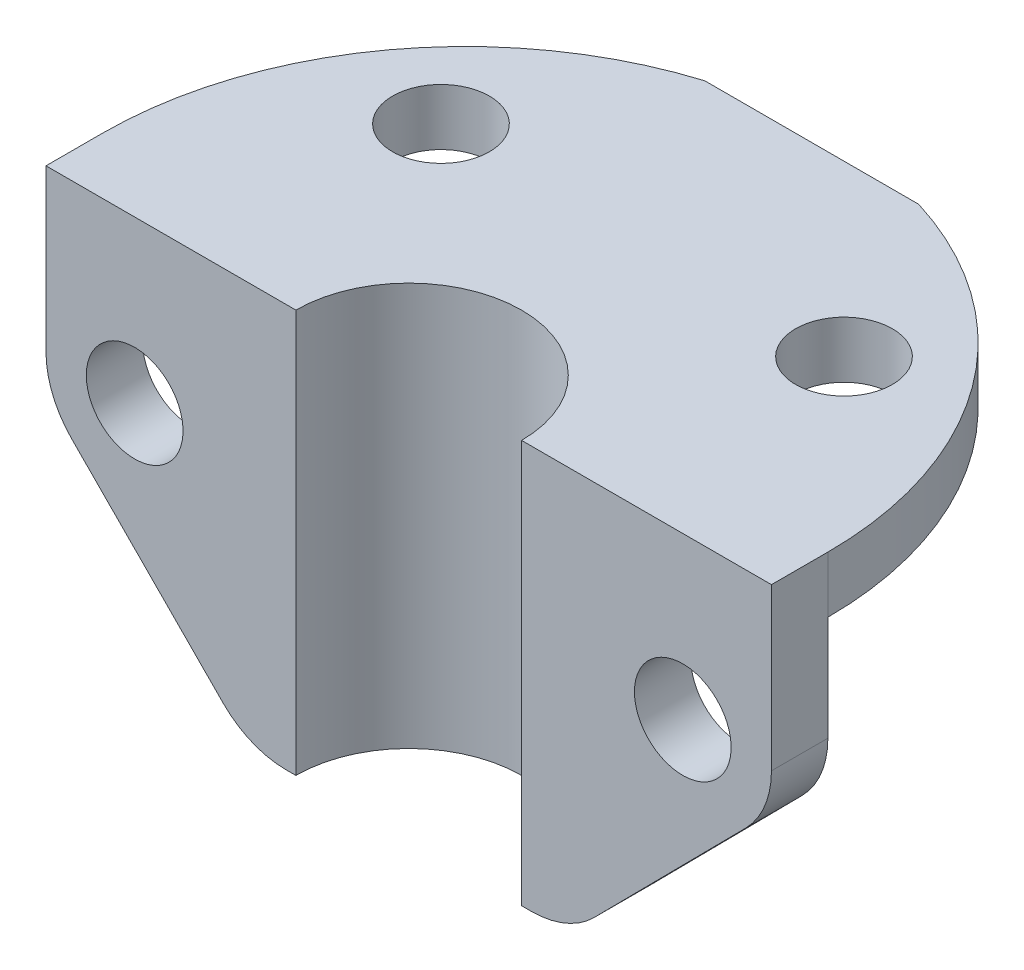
from build123d import *

# Parameters (mm, degrees)
RESSALTO_EXTRUS_O9_DEPTH  = 50
ESBO_O5_R                 = 6
CORTE_EXTRUS_O1_DEPTH     = 43
CORTE_EXTRUS_O2_DEPTH     = 43
FILETE1_R                 = 11
CORTE_EXTRUS_O3_DEPTH     = 43
FILETE2_R                 = 11
RESSALTO_EXTRUS_O12_START = -7
RESSALTO_EXTRUS_O12_DEPTH = 7
ESBO_O12_W                = 90
ESBO_O12_H                = 5
CORTE_EXTRUS_O7_DEPTH     = 7
ESBO_O13_R                = 6
CORTE_EXTRUS_O8_DEPTH     = 7


with BuildPart() as part:
    # Esbo_o4 → Ressalto-extrus_o9 (new body)
    with BuildSketch(Plane(origin=(0, 0, 0), x_dir=(1, 0, 0), z_dir=(0, 1, 0))):
        with BuildLine():
            Line((32.875644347, 0), (25.201010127, 0))
            ThreePointArc((25.201010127, 0), (24.302430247, -3.448858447), (24, -7))
            Line((24, -7), (31, -7))
            ThreePointArc((31, -7), (31.477038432, -3.376533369), (32.875644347, 0))
        make_face()
        with BuildLine():
            ThreePointArc((66, -7), (65.697569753, -3.448858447), (64.798989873, 0))
            Line((64.798989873, 0), (57.124355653, 0))
            ThreePointArc((57.124355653, 0), (58.522961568, -3.376533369), (59, -7))
            Line((59, -7), (66, -7))
        make_face()
        with BuildLine():
            Line((32.875644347, 0), (25.201010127, 0))
            ThreePointArc((25.201010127, 0), (24.302430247, -3.448858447), (24, -7))
            Line((24, -7), (31, -7))
            ThreePointArc((31, -7), (31.477038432, -3.376533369), (32.875644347, 0))
        make_face()
        with BuildLine():
            ThreePointArc((66, -7), (65.697569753, -3.448858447), (64.798989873, 0))
            Line((64.798989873, 0), (57.124355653, 0))
            ThreePointArc((57.124355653, 0), (58.522961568, -3.376533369), (59, -7))
            Line((59, -7), (66, -7))
        make_face()
        with BuildLine():
            ThreePointArc((64.798989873, 0), (45, 14), (25.201010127, 0))
            Line((25.201010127, 0), (32.875644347, 0))
            ThreePointArc((32.875644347, 0), (45, 7), (57.124355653, 0))
            Line((57.124355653, 0), (64.798989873, 0))
        make_face()
        with BuildLine():
            Line((90, 0), (64.798989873, 0))
            ThreePointArc((64.798989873, 0), (65.697569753, -3.448858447), (66, -7))
            Line((66, -7), (90, -7))
            Line((90, -7), (90, 0))
        make_face()
        with BuildLine():
            Line((25.201010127, 0), (0, 0))
            Line((0, 0), (0, -7))
            Line((0, -7), (24, -7))
            ThreePointArc((24, -7), (24.302430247, -3.448858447), (25.201010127, 0))
        make_face()
    extrude(amount=RESSALTO_EXTRUS_O9_DEPTH)

    # Esbo_o5 → Corte-extrus_o1 (cut)
    with BuildSketch(Plane(origin=(0, 0, 0), x_dir=(-1, 0, 0), z_dir=(0, 0, -1))):
        with Locations((-11, 30)):
            Circle(ESBO_O5_R)
        with Locations((-79, 30)):
            Circle(ESBO_O5_R)
    extrude(amount=-CORTE_EXTRUS_O1_DEPTH, mode=Mode.SUBTRACT)

    # Esbo_o6 → Corte-extrus_o2 (cut)
    with BuildSketch(Plane(origin=(0, 0, 0), x_dir=(-1, 0, 0), z_dir=(0, 0, -1))):
        with BuildLine():
            Line((-90, 0), (-64.798989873, 0))
            Line((-64.798989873, 0), (-86.820713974, 22.264598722))
            ThreePointArc((-86.820713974, 22.264598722), (-89.174179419, 25.818364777), (-90, 30))
            Line((-90, 30), (-90, 0))
        make_face()
    extrude(amount=-CORTE_EXTRUS_O2_DEPTH, mode=Mode.SUBTRACT)

    # Filete1
    filete1_edges = [part.edges().sort_by_distance(p)[0] for p in [
        (64.798989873, 0, 3.5),
    ]]
    fillet(filete1_edges, radius=FILETE1_R)

    # Esbo_o6_3 → Corte-extrus_o3 (cut)
    with BuildSketch(Plane(origin=(0, 0, 0), x_dir=(-1, 0, 0), z_dir=(0, 0, -1))):
        with BuildLine():
            Line((-3.179286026, 22.264598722), (-25.201010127, 0))
            Line((-25.201010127, 0), (0, 0))
            Line((0, 0), (0, 30))
            ThreePointArc((0, 30), (-0.825820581, 25.818364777), (-3.179286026, 22.264598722))
        make_face()
    extrude(amount=-CORTE_EXTRUS_O3_DEPTH, mode=Mode.SUBTRACT)

    # Filete2
    filete2_edges = [part.edges().sort_by_distance(p)[0] for p in [
        (25.201010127, 0, 3.5),
    ]]
    fillet(filete2_edges, radius=FILETE2_R)

    # Esbo_o7 → Ressalto-extrus_o12 (add)
    with BuildSketch(Plane(origin=(0, 50, 0), x_dir=(1, 0, 0), z_dir=(0, 1, 0)).offset(RESSALTO_EXTRUS_O12_START)):
        with BuildLine():
            ThreePointArc((90, 0), (45, 45), (0, 0))
            Line((0, 0), (32.875644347, 0))
            ThreePointArc((32.875644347, 0), (45, 7), (57.124355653, 0))
            Line((57.124355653, 0), (90, 0))
        make_face()
    extrude(amount=RESSALTO_EXTRUS_O12_DEPTH)

    # Esbo_o12 → Corte-extrus_o7 (cut)
    with BuildSketch(Plane(origin=(0, 50, 0), x_dir=(1, 0, 0), z_dir=(0, 1, 0))):
        with Locations((45, 45.5)):
            Rectangle(ESBO_O12_W, ESBO_O12_H)
    extrude(amount=-CORTE_EXTRUS_O7_DEPTH, mode=Mode.SUBTRACT)

    # Esbo_o13 → Corte-extrus_o8 (cut)
    with BuildSketch(Plane.XZ.offset(-43)):
        with Locations(Location((20, -22, 0), (0, 0, 270))):
            Circle(ESBO_O13_R)
        with Locations(Location((70, -22, 0), (0, 0, 270))):
            Circle(ESBO_O13_R)
    extrude(amount=-CORTE_EXTRUS_O8_DEPTH, mode=Mode.SUBTRACT)


solid = part.part
